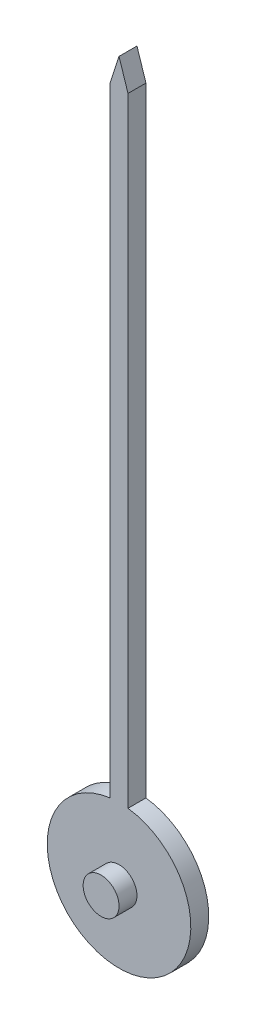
ISO-10303-21;
HEADER;
FILE_DESCRIPTION(('STEP AP214'),'2;1');
FILE_NAME('part.step','',(''),(''),'','','');
FILE_SCHEMA(('AUTOMOTIVE_DESIGN { 1 0 10303 214 1 1 1 1 }'));
ENDSEC;
DATA;
#1=APPLICATION_CONTEXT('core data for automotive mechanical design processes');
#2=APPLICATION_PROTOCOL_DEFINITION('international standard','automotive_design',2000,#1);
#3=PRODUCT_CONTEXT('',#1,'mechanical');
#4=PRODUCT('Part','Part','',(#3));
#5=PRODUCT_RELATED_PRODUCT_CATEGORY('part','',(#4));
#6=PRODUCT_DEFINITION_FORMATION('','',#4);
#7=PRODUCT_DEFINITION_CONTEXT('part definition',#1,'design');
#8=PRODUCT_DEFINITION('design','',#6,#7);
#9=PRODUCT_DEFINITION_SHAPE('','',#8);
#10=(LENGTH_UNIT() NAMED_UNIT(*) SI_UNIT(.MILLI.,.METRE.));
#11=(NAMED_UNIT(*) PLANE_ANGLE_UNIT() SI_UNIT($,.RADIAN.));
#12=(NAMED_UNIT(*) SI_UNIT($,.STERADIAN.) SOLID_ANGLE_UNIT());
#13=UNCERTAINTY_MEASURE_WITH_UNIT(LENGTH_MEASURE(1.E-05),#10,'distance_accuracy_value','');
#14=(GEOMETRIC_REPRESENTATION_CONTEXT(3) GLOBAL_UNCERTAINTY_ASSIGNED_CONTEXT((#13)) GLOBAL_UNIT_ASSIGNED_CONTEXT((#10,
#11,#12)) REPRESENTATION_CONTEXT('',''));
#15=CARTESIAN_POINT('',(0.,0.,0.));
#16=DIRECTION('',(0.,0.,1.));
#17=DIRECTION('',(1.,0.,0.));
#18=AXIS2_PLACEMENT_3D('',#15,#16,#17);
#19=CARTESIAN_POINT('',(0.,0.,1.));
#20=DIRECTION('',(0.,0.,1.));
#21=DIRECTION('',(1.,0.,0.));
#22=AXIS2_PLACEMENT_3D('',#19,#20,#21);
#23=PLANE('',#22);
#24=DIRECTION('',(-0.309033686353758,0.951051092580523,0.));
#25=VECTOR('',#24,1.);
#26=CARTESIAN_POINT('',(0.,40.,1.));
#27=LINE('',#26,#25);
#28=CARTESIAN_POINT('',(0.500000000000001,38.4612501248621,1.));
#29=VERTEX_POINT('',#28);
#30=CARTESIAN_POINT('',(0.,40.,1.));
#31=VERTEX_POINT('',#30);
#32=EDGE_CURVE('E117',#29,#31,#27,.T.);
#33=ORIENTED_EDGE('',*,*,#32,.T.);
#34=DIRECTION('',(-0.309033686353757,-0.951051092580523,0.));
#35=VECTOR('',#34,1.);
#36=CARTESIAN_POINT('',(0.,40.,1.));
#37=LINE('',#36,#35);
#38=CARTESIAN_POINT('',(-0.5,38.4612501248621,1.));
#39=VERTEX_POINT('',#38);
#40=EDGE_CURVE('E84',#31,#39,#37,.T.);
#41=ORIENTED_EDGE('',*,*,#40,.T.);
#42=DIRECTION('',(0.,-1.,0.));
#43=VECTOR('',#42,1.);
#44=CARTESIAN_POINT('',(-0.5,38.4612501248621,1.));
#45=LINE('',#44,#43);
#46=CARTESIAN_POINT('',(-0.499999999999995,3.96862696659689,1.));
#47=VERTEX_POINT('',#46);
#48=EDGE_CURVE('E88',#39,#47,#45,.T.);
#49=ORIENTED_EDGE('',*,*,#48,.T.);
#50=CARTESIAN_POINT('',(0.,0.,1.));
#51=DIRECTION('',(0.,0.,1.));
#52=DIRECTION('',(1.,0.,0.));
#53=AXIS2_PLACEMENT_3D('',#50,#51,#52);
#54=CIRCLE('',#53,4.);
#55=CARTESIAN_POINT('',(0.500000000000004,3.96862696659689,1.));
#56=VERTEX_POINT('',#55);
#57=EDGE_CURVE('E92',#47,#56,#54,.T.);
#58=ORIENTED_EDGE('',*,*,#57,.T.);
#59=DIRECTION('',(0.,1.,0.));
#60=VECTOR('',#59,1.);
#61=CARTESIAN_POINT('',(0.500000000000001,38.4612501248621,1.));
#62=LINE('',#61,#60);
#63=EDGE_CURVE('E50',#56,#29,#62,.T.);
#64=ORIENTED_EDGE('',*,*,#63,.T.);
#65=EDGE_LOOP('',(#33,#41,#49,#58,#64));
#66=FACE_BOUND('',#65,.T.);
#67=CARTESIAN_POINT('',(0.,0.,1.));
#68=DIRECTION('',(0.,0.,1.));
#69=DIRECTION('',(1.,0.,0.));
#70=AXIS2_PLACEMENT_3D('',#67,#68,#69);
#71=CIRCLE('',#70,1.);
#72=CARTESIAN_POINT('',(1.,0.,1.));
#73=VERTEX_POINT('',#72);
#74=EDGE_CURVE('E152',#73,#73,#71,.T.);
#75=ORIENTED_EDGE('',*,*,#74,.F.);
#76=EDGE_LOOP('',(#75));
#77=FACE_BOUND('',#76,.T.);
#78=ADVANCED_FACE('F33',(#66,#77),#23,.T.);
#79=CARTESIAN_POINT('',(0.,40.,1.));
#80=DIRECTION('',(-0.951051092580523,-0.309033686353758,0.));
#81=DIRECTION('',(0.309033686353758,-0.951051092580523,0.));
#82=AXIS2_PLACEMENT_3D('',#79,#80,#81);
#83=PLANE('',#82);
#84=DIRECTION('',(-0.309033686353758,0.951051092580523,0.));
#85=VECTOR('',#84,1.);
#86=CARTESIAN_POINT('',(0.,40.,0.));
#87=LINE('',#86,#85);
#88=CARTESIAN_POINT('',(0.500000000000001,38.4612501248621,0.));
#89=VERTEX_POINT('',#88);
#90=CARTESIAN_POINT('',(0.,40.,0.));
#91=VERTEX_POINT('',#90);
#92=EDGE_CURVE('E108',#89,#91,#87,.T.);
#93=ORIENTED_EDGE('',*,*,#92,.T.);
#94=DIRECTION('',(0.,0.,-1.));
#95=VECTOR('',#94,1.);
#96=CARTESIAN_POINT('',(0.,40.,1.));
#97=LINE('',#96,#95);
#98=EDGE_CURVE('E11',#31,#91,#97,.T.);
#99=ORIENTED_EDGE('',*,*,#98,.F.);
#100=ORIENTED_EDGE('',*,*,#32,.F.);
#101=DIRECTION('',(0.,0.,-1.));
#102=VECTOR('',#101,1.);
#103=CARTESIAN_POINT('',(0.500000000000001,38.4612501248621,1.));
#104=LINE('',#103,#102);
#105=EDGE_CURVE('E104',#29,#89,#104,.T.);
#106=ORIENTED_EDGE('',*,*,#105,.T.);
#107=EDGE_LOOP('',(#93,#99,#100,#106));
#108=FACE_BOUND('',#107,.T.);
#109=ADVANCED_FACE('F35',(#108),#83,.F.);
#110=CARTESIAN_POINT('',(0.,40.,1.));
#111=DIRECTION('',(0.951051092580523,-0.309033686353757,0.));
#112=DIRECTION('',(0.309033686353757,0.951051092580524,0.));
#113=AXIS2_PLACEMENT_3D('',#110,#111,#112);
#114=PLANE('',#113);
#115=DIRECTION('',(-0.309033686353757,-0.951051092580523,0.));
#116=VECTOR('',#115,1.);
#117=CARTESIAN_POINT('',(0.,40.,0.));
#118=LINE('',#117,#116);
#119=CARTESIAN_POINT('',(-0.5,38.4612501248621,0.));
#120=VERTEX_POINT('',#119);
#121=EDGE_CURVE('E111',#91,#120,#118,.T.);
#122=ORIENTED_EDGE('',*,*,#121,.T.);
#123=DIRECTION('',(0.,0.,-1.));
#124=VECTOR('',#123,1.);
#125=CARTESIAN_POINT('',(-0.5,38.4612501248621,1.));
#126=LINE('',#125,#124);
#127=EDGE_CURVE('E42',#39,#120,#126,.T.);
#128=ORIENTED_EDGE('',*,*,#127,.F.);
#129=ORIENTED_EDGE('',*,*,#40,.F.);
#130=ORIENTED_EDGE('',*,*,#98,.T.);
#131=EDGE_LOOP('',(#122,#128,#129,#130));
#132=FACE_BOUND('',#131,.T.);
#133=ADVANCED_FACE('F140',(#132),#114,.F.);
#134=CARTESIAN_POINT('',(-0.5,38.4612501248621,1.));
#135=DIRECTION('',(1.,0.,0.));
#136=DIRECTION('',(0.,1.,0.));
#137=AXIS2_PLACEMENT_3D('',#134,#135,#136);
#138=PLANE('',#137);
#139=DIRECTION('',(0.,-1.,0.));
#140=VECTOR('',#139,1.);
#141=CARTESIAN_POINT('',(-0.5,38.4612501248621,0.));
#142=LINE('',#141,#140);
#143=CARTESIAN_POINT('',(-0.499999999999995,3.96862696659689,0.));
#144=VERTEX_POINT('',#143);
#145=EDGE_CURVE('E99',#120,#144,#142,.T.);
#146=ORIENTED_EDGE('',*,*,#145,.T.);
#147=DIRECTION('',(0.,0.,-1.));
#148=VECTOR('',#147,1.);
#149=CARTESIAN_POINT('',(-0.499999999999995,3.96862696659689,1.));
#150=LINE('',#149,#148);
#151=EDGE_CURVE('E96',#47,#144,#150,.T.);
#152=ORIENTED_EDGE('',*,*,#151,.F.);
#153=ORIENTED_EDGE('',*,*,#48,.F.);
#154=ORIENTED_EDGE('',*,*,#127,.T.);
#155=EDGE_LOOP('',(#146,#152,#153,#154));
#156=FACE_BOUND('',#155,.T.);
#157=ADVANCED_FACE('F97',(#156),#138,.F.);
#158=CARTESIAN_POINT('',(0.,0.,1.));
#159=DIRECTION('',(0.,0.,-1.));
#160=DIRECTION('',(-1.,0.,0.));
#161=AXIS2_PLACEMENT_3D('',#158,#159,#160);
#162=CYLINDRICAL_SURFACE('',#161,4.);
#163=CARTESIAN_POINT('',(0.,0.,0.));
#164=DIRECTION('',(0.,0.,1.));
#165=DIRECTION('',(1.,0.,0.));
#166=AXIS2_PLACEMENT_3D('',#163,#164,#165);
#167=CIRCLE('',#166,4.);
#168=CARTESIAN_POINT('',(0.500000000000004,3.96862696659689,0.));
#169=VERTEX_POINT('',#168);
#170=EDGE_CURVE('E70',#144,#169,#167,.T.);
#171=ORIENTED_EDGE('',*,*,#170,.T.);
#172=DIRECTION('',(0.,0.,-1.));
#173=VECTOR('',#172,1.);
#174=CARTESIAN_POINT('',(0.500000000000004,3.96862696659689,1.));
#175=LINE('',#174,#173);
#176=EDGE_CURVE('E100',#56,#169,#175,.T.);
#177=ORIENTED_EDGE('',*,*,#176,.F.);
#178=ORIENTED_EDGE('',*,*,#57,.F.);
#179=ORIENTED_EDGE('',*,*,#151,.T.);
#180=EDGE_LOOP('',(#171,#177,#178,#179));
#181=FACE_BOUND('',#180,.T.);
#182=ADVANCED_FACE('F102',(#181),#162,.T.);
#183=CARTESIAN_POINT('',(0.500000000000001,38.4612501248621,1.));
#184=DIRECTION('',(-1.,0.,0.));
#185=DIRECTION('',(0.,-1.,0.));
#186=AXIS2_PLACEMENT_3D('',#183,#184,#185);
#187=PLANE('',#186);
#188=DIRECTION('',(0.,1.,0.));
#189=VECTOR('',#188,1.);
#190=CARTESIAN_POINT('',(0.500000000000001,38.4612501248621,0.));
#191=LINE('',#190,#189);
#192=EDGE_CURVE('E76',#169,#89,#191,.T.);
#193=ORIENTED_EDGE('',*,*,#192,.T.);
#194=ORIENTED_EDGE('',*,*,#105,.F.);
#195=ORIENTED_EDGE('',*,*,#63,.F.);
#196=ORIENTED_EDGE('',*,*,#176,.T.);
#197=EDGE_LOOP('',(#193,#194,#195,#196));
#198=FACE_BOUND('',#197,.T.);
#199=ADVANCED_FACE('F125',(#198),#187,.F.);
#200=CARTESIAN_POINT('',(0.,0.,0.));
#201=DIRECTION('',(0.,0.,1.));
#202=DIRECTION('',(1.,0.,0.));
#203=AXIS2_PLACEMENT_3D('',#200,#201,#202);
#204=PLANE('',#203);
#205=ORIENTED_EDGE('',*,*,#92,.F.);
#206=ORIENTED_EDGE('',*,*,#192,.F.);
#207=ORIENTED_EDGE('',*,*,#170,.F.);
#208=ORIENTED_EDGE('',*,*,#145,.F.);
#209=ORIENTED_EDGE('',*,*,#121,.F.);
#210=EDGE_LOOP('',(#205,#206,#207,#208,#209));
#211=FACE_BOUND('',#210,.T.);
#212=ADVANCED_FACE('F121',(#211),#204,.F.);
#213=CARTESIAN_POINT('',(0.,0.,2.));
#214=DIRECTION('',(0.,0.,-1.));
#215=DIRECTION('',(-1.,0.,0.));
#216=AXIS2_PLACEMENT_3D('',#213,#214,#215);
#217=CYLINDRICAL_SURFACE('',#216,1.);
#218=CARTESIAN_POINT('',(0.,0.,2.));
#219=DIRECTION('',(0.,0.,1.));
#220=DIRECTION('',(1.,0.,0.));
#221=AXIS2_PLACEMENT_3D('',#218,#219,#220);
#222=CIRCLE('',#221,1.);
#223=CARTESIAN_POINT('',(1.,0.,2.));
#224=VERTEX_POINT('',#223);
#225=EDGE_CURVE('E112',#224,#224,#222,.T.);
#226=ORIENTED_EDGE('',*,*,#225,.F.);
#227=EDGE_LOOP('',(#226));
#228=FACE_BOUND('',#227,.T.);
#229=ORIENTED_EDGE('',*,*,#74,.T.);
#230=EDGE_LOOP('',(#229));
#231=FACE_BOUND('',#230,.T.);
#232=ADVANCED_FACE('F132',(#228,#231),#217,.T.);
#233=CARTESIAN_POINT('',(0.,0.,2.));
#234=DIRECTION('',(0.,0.,1.));
#235=DIRECTION('',(1.,0.,0.));
#236=AXIS2_PLACEMENT_3D('',#233,#234,#235);
#237=PLANE('',#236);
#238=ORIENTED_EDGE('',*,*,#225,.T.);
#239=EDGE_LOOP('',(#238));
#240=FACE_BOUND('',#239,.T.);
#241=ADVANCED_FACE('F144',(#240),#237,.T.);
#242=CLOSED_SHELL('',(#78,#109,#133,#157,#182,#199,#212,#232,#241));
#243=MANIFOLD_SOLID_BREP('B2',#242);
#244=ADVANCED_BREP_SHAPE_REPRESENTATION('',(#18,#243),#14);
#245=SHAPE_DEFINITION_REPRESENTATION(#9,#244);
ENDSEC;
END-ISO-10303-21;
